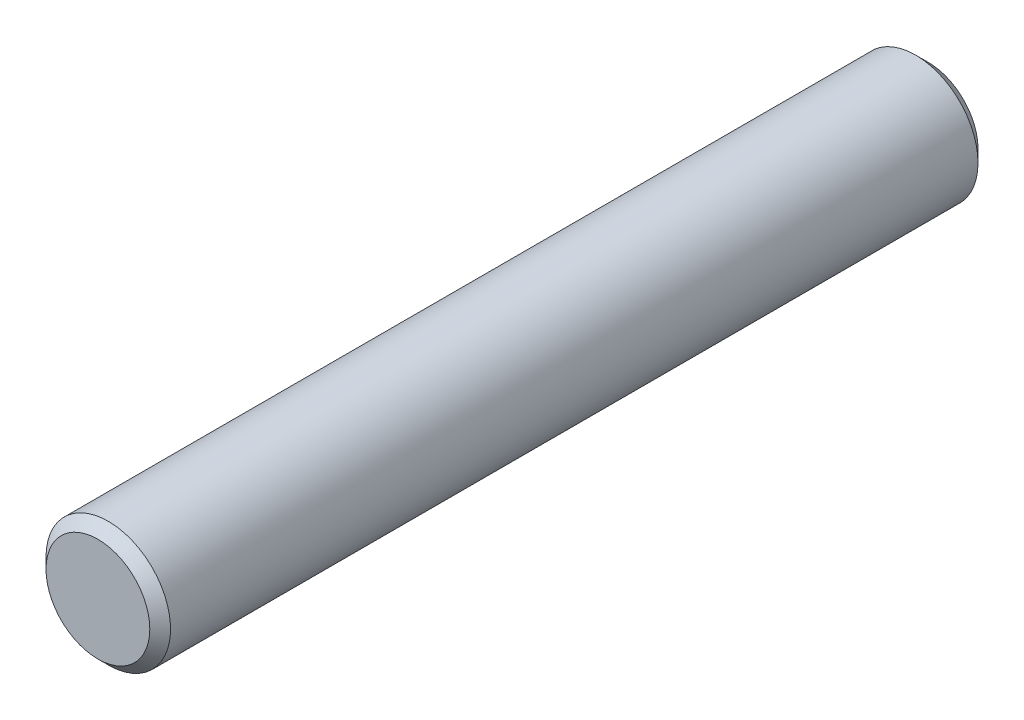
ISO-10303-21;
HEADER;
FILE_DESCRIPTION(('STEP AP214'),'2;1');
FILE_NAME('part.step','',(''),(''),'','','');
FILE_SCHEMA(('AUTOMOTIVE_DESIGN { 1 0 10303 214 1 1 1 1 }'));
ENDSEC;
DATA;
#1=APPLICATION_CONTEXT('core data for automotive mechanical design processes');
#2=APPLICATION_PROTOCOL_DEFINITION('international standard','automotive_design',2000,#1);
#3=PRODUCT_CONTEXT('',#1,'mechanical');
#4=PRODUCT('Part','Part','',(#3));
#5=PRODUCT_RELATED_PRODUCT_CATEGORY('part','',(#4));
#6=PRODUCT_DEFINITION_FORMATION('','',#4);
#7=PRODUCT_DEFINITION_CONTEXT('part definition',#1,'design');
#8=PRODUCT_DEFINITION('design','',#6,#7);
#9=PRODUCT_DEFINITION_SHAPE('','',#8);
#10=(LENGTH_UNIT() NAMED_UNIT(*) SI_UNIT(.MILLI.,.METRE.));
#11=(NAMED_UNIT(*) PLANE_ANGLE_UNIT() SI_UNIT($,.RADIAN.));
#12=(NAMED_UNIT(*) SI_UNIT($,.STERADIAN.) SOLID_ANGLE_UNIT());
#13=UNCERTAINTY_MEASURE_WITH_UNIT(LENGTH_MEASURE(1.E-05),#10,'distance_accuracy_value','');
#14=(GEOMETRIC_REPRESENTATION_CONTEXT(3) GLOBAL_UNCERTAINTY_ASSIGNED_CONTEXT((#13)) GLOBAL_UNIT_ASSIGNED_CONTEXT((#10,
#11,#12)) REPRESENTATION_CONTEXT('',''));
#15=CARTESIAN_POINT('',(0.,0.,0.));
#16=DIRECTION('',(0.,0.,1.));
#17=DIRECTION('',(1.,0.,0.));
#18=AXIS2_PLACEMENT_3D('',#15,#16,#17);
#19=CARTESIAN_POINT('',(0.,0.,38.1));
#20=DIRECTION('',(0.,0.,-1.));
#21=DIRECTION('',(-1.,0.,0.));
#22=AXIS2_PLACEMENT_3D('',#19,#20,#21);
#23=CYLINDRICAL_SURFACE('',#22,2.38125);
#24=CARTESIAN_POINT('',(0.,0.,-6.74687499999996));
#25=DIRECTION('',(0.,0.,1.));
#26=DIRECTION('',(1.,0.,0.));
#27=AXIS2_PLACEMENT_3D('',#24,#25,#26);
#28=CIRCLE('',#27,2.38125);
#29=CARTESIAN_POINT('',(-2.38125,0.,-6.74687499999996));
#30=VERTEX_POINT('',#29);
#31=EDGE_CURVE('E10',#30,#30,#28,.F.);
#32=CARTESIAN_POINT('',(0.,0.,-37.6237499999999));
#33=DIRECTION('',(0.,0.,1.));
#34=DIRECTION('',(1.,0.,0.));
#35=AXIS2_PLACEMENT_3D('',#32,#33,#34);
#36=CIRCLE('',#35,2.38125);
#37=CARTESIAN_POINT('',(-2.38125,0.,-37.6237499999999));
#38=VERTEX_POINT('',#37);
#39=EDGE_CURVE('E45',#38,#38,#36,.T.);
#40=CARTESIAN_POINT('',(-2.38125,0.,-6.74687499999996));
#41=CARTESIAN_POINT('',(-2.38125,0.,-7.06850911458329));
#42=CARTESIAN_POINT('',(-2.38125,0.,-7.39014322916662));
#43=CARTESIAN_POINT('',(-2.38125,0.,-8.03341145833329));
#44=CARTESIAN_POINT('',(-2.38125,0.,-8.35504557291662));
#45=CARTESIAN_POINT('',(-2.38125,0.,-8.99831380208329));
#46=CARTESIAN_POINT('',(-2.38125,0.,-9.31994791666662));
#47=CARTESIAN_POINT('',(-2.38125,0.,-9.96321614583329));
#48=CARTESIAN_POINT('',(-2.38125,0.,-10.2848502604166));
#49=CARTESIAN_POINT('',(-2.38125,0.,-10.9281184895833));
#50=CARTESIAN_POINT('',(-2.38125,0.,-11.2497526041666));
#51=CARTESIAN_POINT('',(-2.38125,0.,-11.8930208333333));
#52=CARTESIAN_POINT('',(-2.38125,0.,-12.2146549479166));
#53=CARTESIAN_POINT('',(-2.38125,0.,-12.8579231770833));
#54=CARTESIAN_POINT('',(-2.38125,0.,-13.1795572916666));
#55=CARTESIAN_POINT('',(-2.38125,0.,-13.8228255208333));
#56=CARTESIAN_POINT('',(-2.38125,0.,-14.1444596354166));
#57=CARTESIAN_POINT('',(-2.38125,0.,-14.7877278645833));
#58=CARTESIAN_POINT('',(-2.38125,0.,-15.1093619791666));
#59=CARTESIAN_POINT('',(-2.38125,0.,-15.7526302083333));
#60=CARTESIAN_POINT('',(-2.38125,0.,-16.0742643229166));
#61=CARTESIAN_POINT('',(-2.38125,0.,-16.7175325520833));
#62=CARTESIAN_POINT('',(-2.38125,0.,-17.0391666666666));
#63=CARTESIAN_POINT('',(-2.38125,0.,-17.6824348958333));
#64=CARTESIAN_POINT('',(-2.38125,0.,-18.0040690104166));
#65=CARTESIAN_POINT('',(-2.38125,0.,-18.6473372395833));
#66=CARTESIAN_POINT('',(-2.38125,0.,-18.9689713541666));
#67=CARTESIAN_POINT('',(-2.38125,0.,-19.6122395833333));
#68=CARTESIAN_POINT('',(-2.38125,0.,-19.9338736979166));
#69=CARTESIAN_POINT('',(-2.38125,0.,-20.5771419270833));
#70=CARTESIAN_POINT('',(-2.38125,0.,-20.8987760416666));
#71=CARTESIAN_POINT('',(-2.38125,0.,-21.5420442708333));
#72=CARTESIAN_POINT('',(-2.38125,0.,-21.8636783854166));
#73=CARTESIAN_POINT('',(-2.38125,0.,-22.5069466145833));
#74=CARTESIAN_POINT('',(-2.38125,0.,-22.8285807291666));
#75=CARTESIAN_POINT('',(-2.38125,0.,-23.4718489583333));
#76=CARTESIAN_POINT('',(-2.38125,0.,-23.7934830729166));
#77=CARTESIAN_POINT('',(-2.38125,0.,-24.4367513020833));
#78=CARTESIAN_POINT('',(-2.38125,0.,-24.7583854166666));
#79=CARTESIAN_POINT('',(-2.38125,0.,-25.4016536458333));
#80=CARTESIAN_POINT('',(-2.38125,0.,-25.7232877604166));
#81=CARTESIAN_POINT('',(-2.38125,0.,-26.3665559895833));
#82=CARTESIAN_POINT('',(-2.38125,0.,-26.6881901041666));
#83=CARTESIAN_POINT('',(-2.38125,0.,-27.3314583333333));
#84=CARTESIAN_POINT('',(-2.38125,0.,-27.6530924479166));
#85=CARTESIAN_POINT('',(-2.38125,0.,-28.2963606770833));
#86=CARTESIAN_POINT('',(-2.38125,0.,-28.6179947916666));
#87=CARTESIAN_POINT('',(-2.38125,0.,-29.2612630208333));
#88=CARTESIAN_POINT('',(-2.38125,0.,-29.5828971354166));
#89=CARTESIAN_POINT('',(-2.38125,0.,-30.2261653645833));
#90=CARTESIAN_POINT('',(-2.38125,0.,-30.5477994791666));
#91=CARTESIAN_POINT('',(-2.38125,0.,-31.1910677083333));
#92=CARTESIAN_POINT('',(-2.38125,0.,-31.5127018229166));
#93=CARTESIAN_POINT('',(-2.38125,0.,-32.1559700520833));
#94=CARTESIAN_POINT('',(-2.38125,0.,-32.4776041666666));
#95=CARTESIAN_POINT('',(-2.38125,0.,-33.1208723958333));
#96=CARTESIAN_POINT('',(-2.38125,0.,-33.4425065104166));
#97=CARTESIAN_POINT('',(-2.38125,0.,-34.0857747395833));
#98=CARTESIAN_POINT('',(-2.38125,0.,-34.4074088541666));
#99=CARTESIAN_POINT('',(-2.38125,0.,-35.0506770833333));
#100=CARTESIAN_POINT('',(-2.38125,0.,-35.3723111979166));
#101=CARTESIAN_POINT('',(-2.38125,0.,-36.0155794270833));
#102=CARTESIAN_POINT('',(-2.38125,0.,-36.3372135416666));
#103=CARTESIAN_POINT('',(-2.38125,0.,-36.9804817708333));
#104=CARTESIAN_POINT('',(-2.38125,0.,-37.3021158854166));
#105=CARTESIAN_POINT('',(-2.38125,0.,-37.6237499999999));
#106=B_SPLINE_CURVE_WITH_KNOTS('',3,(#40,#41,#42,#43,#44,#45,#46,#47,#48,#49,#50,#51,#52,#53,
#54,#55,#56,#57,#58,#59,#60,#61,#62,#63,#64,#65,#66,#67,#68,#69,#70,#71,#72,#73,#74,#75,#76,#77,
#78,#79,#80,#81,#82,#83,#84,#85,#86,#87,#88,#89,#90,#91,#92,#93,#94,#95,#96,#97,#98,#99,#100,
#101,#102,#103,#104,#105),.UNSPECIFIED.,.F.,.F.,(4,2,2,2,2,2,2,2,2,2,2,2,2,2,2,2,2,2,2,2,2,2,2,
2,2,2,2,2,2,2,2,2,4),(0.,0.964902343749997,1.9298046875,2.89470703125,3.859609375,
4.82451171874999,5.7894140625,6.75431640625,7.71921874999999,8.68412109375,9.6490234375,
10.61392578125,11.578828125,12.54373046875,13.5086328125,14.47353515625,15.4384375,
16.40333984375,17.3682421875,18.33314453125,19.298046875,20.26294921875,21.2278515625,
22.19275390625,23.15765625,24.12255859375,25.0874609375,26.05236328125,27.017265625,
27.98216796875,28.9470703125,29.91197265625,30.876875),.UNSPECIFIED.);
#107=EDGE_CURVE('BSEAM30',#30,#38,#106,.T.);
#108=ORIENTED_EDGE('',*,*,#31,.T.);
#109=ORIENTED_EDGE('',*,*,#39,.T.);
#110=ORIENTED_EDGE('',*,*,#107,.T.);
#111=ORIENTED_EDGE('',*,*,#107,.F.);
#112=EDGE_LOOP('',(#108,#110,#109,#111));
#113=FACE_BOUND('',#112,.T.);
#114=ADVANCED_FACE('F30',(#113),#23,.T.);
#115=CARTESIAN_POINT('',(0.,0.,-38.1));
#116=DIRECTION('',(0.,0.,1.));
#117=DIRECTION('',(1.,0.,0.));
#118=AXIS2_PLACEMENT_3D('',#115,#116,#117);
#119=PLANE('',#118);
#120=CARTESIAN_POINT('',(0.,0.,-38.1));
#121=DIRECTION('',(0.,0.,1.));
#122=DIRECTION('',(1.,0.,0.));
#123=AXIS2_PLACEMENT_3D('',#120,#121,#122);
#124=CIRCLE('',#123,1.90499999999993);
#125=CARTESIAN_POINT('',(1.90499999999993,0.,-38.1));
#126=VERTEX_POINT('',#125);
#127=EDGE_CURVE('E41',#126,#126,#124,.F.);
#128=ORIENTED_EDGE('',*,*,#127,.T.);
#129=EDGE_LOOP('',(#128));
#130=FACE_BOUND('',#129,.T.);
#131=ADVANCED_FACE('F55',(#130),#119,.F.);
#132=CARTESIAN_POINT('',(0.,0.,-37.6237499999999));
#133=DIRECTION('',(0.,0.,1.));
#134=DIRECTION('',(1.,0.,0.));
#135=AXIS2_PLACEMENT_3D('',#132,#133,#134);
#136=CONICAL_SURFACE('',#135,2.38125,0.78539816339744);
#137=ORIENTED_EDGE('',*,*,#127,.F.);
#138=EDGE_LOOP('',(#137));
#139=FACE_BOUND('',#138,.T.);
#140=ORIENTED_EDGE('',*,*,#39,.F.);
#141=EDGE_LOOP('',(#140));
#142=FACE_BOUND('',#141,.T.);
#143=ADVANCED_FACE('F52',(#139,#142),#136,.T.);
#144=CARTESIAN_POINT('',(0.,0.,-6.34999999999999));
#145=DIRECTION('',(0.,0.,1.));
#146=DIRECTION('',(1.,0.,0.));
#147=AXIS2_PLACEMENT_3D('',#144,#145,#146);
#148=PLANE('',#147);
#149=CARTESIAN_POINT('',(0.,0.,-6.34999999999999));
#150=DIRECTION('',(0.,0.,1.));
#151=DIRECTION('',(1.,0.,0.));
#152=AXIS2_PLACEMENT_3D('',#149,#150,#151);
#153=CIRCLE('',#152,1.98437500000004);
#154=CARTESIAN_POINT('',(1.98437500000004,0.,-6.34999999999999));
#155=VERTEX_POINT('',#154);
#156=EDGE_CURVE('E37',#155,#155,#153,.T.);
#157=ORIENTED_EDGE('',*,*,#156,.T.);
#158=EDGE_LOOP('',(#157));
#159=FACE_BOUND('',#158,.T.);
#160=ADVANCED_FACE('F54',(#159),#148,.T.);
#161=CARTESIAN_POINT('',(0.,0.,-6.34999999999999));
#162=DIRECTION('',(0.,0.,-1.));
#163=DIRECTION('',(-1.,0.,0.));
#164=AXIS2_PLACEMENT_3D('',#161,#162,#163);
#165=CONICAL_SURFACE('',#164,1.98437500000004,0.785398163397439);
#166=ORIENTED_EDGE('',*,*,#31,.F.);
#167=EDGE_LOOP('',(#166));
#168=FACE_BOUND('',#167,.T.);
#169=ORIENTED_EDGE('',*,*,#156,.F.);
#170=EDGE_LOOP('',(#169));
#171=FACE_BOUND('',#170,.T.);
#172=ADVANCED_FACE('F32',(#168,#171),#165,.T.);
#173=CLOSED_SHELL('',(#114,#131,#143,#160,#172));
#174=MANIFOLD_SOLID_BREP('B2',#173);
#175=ADVANCED_BREP_SHAPE_REPRESENTATION('',(#18,#174),#14);
#176=SHAPE_DEFINITION_REPRESENTATION(#9,#175);
ENDSEC;
END-ISO-10303-21;
